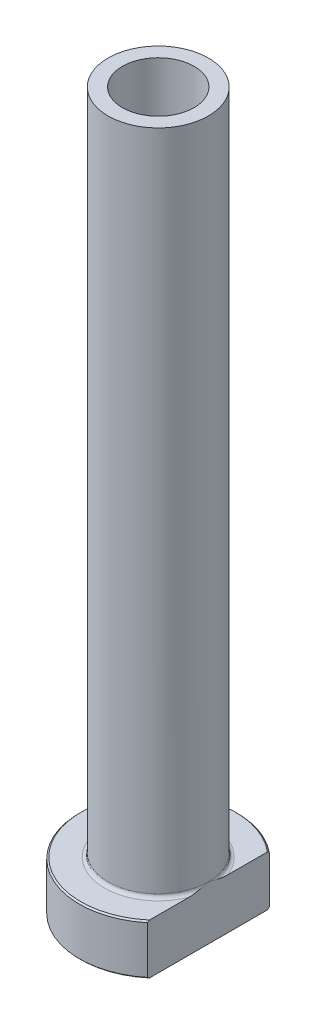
ISO-10303-21;
HEADER;
FILE_DESCRIPTION(('STEP AP214'),'2;1');
FILE_NAME('part.step','',(''),(''),'','','');
FILE_SCHEMA(('AUTOMOTIVE_DESIGN { 1 0 10303 214 1 1 1 1 }'));
ENDSEC;
DATA;
#1=APPLICATION_CONTEXT('core data for automotive mechanical design processes');
#2=APPLICATION_PROTOCOL_DEFINITION('international standard','automotive_design',2000,#1);
#3=PRODUCT_CONTEXT('',#1,'mechanical');
#4=PRODUCT('Part','Part','',(#3));
#5=PRODUCT_RELATED_PRODUCT_CATEGORY('part','',(#4));
#6=PRODUCT_DEFINITION_FORMATION('','',#4);
#7=PRODUCT_DEFINITION_CONTEXT('part definition',#1,'design');
#8=PRODUCT_DEFINITION('design','',#6,#7);
#9=PRODUCT_DEFINITION_SHAPE('','',#8);
#10=(LENGTH_UNIT() NAMED_UNIT(*) SI_UNIT(.MILLI.,.METRE.));
#11=(NAMED_UNIT(*) PLANE_ANGLE_UNIT() SI_UNIT($,.RADIAN.));
#12=(NAMED_UNIT(*) SI_UNIT($,.STERADIAN.) SOLID_ANGLE_UNIT());
#13=UNCERTAINTY_MEASURE_WITH_UNIT(LENGTH_MEASURE(1.E-05),#10,'distance_accuracy_value','');
#14=(GEOMETRIC_REPRESENTATION_CONTEXT(3) GLOBAL_UNCERTAINTY_ASSIGNED_CONTEXT((#13)) GLOBAL_UNIT_ASSIGNED_CONTEXT((#10,
#11,#12)) REPRESENTATION_CONTEXT('',''));
#15=CARTESIAN_POINT('',(0.,0.,0.));
#16=DIRECTION('',(0.,0.,1.));
#17=DIRECTION('',(1.,0.,0.));
#18=AXIS2_PLACEMENT_3D('',#15,#16,#17);
#19=CARTESIAN_POINT('',(0.,92.1876809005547,0.));
#20=DIRECTION('',(0.,1.,0.));
#21=DIRECTION('',(0.,0.,1.));
#22=AXIS2_PLACEMENT_3D('',#19,#20,#21);
#23=CYLINDRICAL_SURFACE('',#22,5.00000000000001);
#24=CARTESIAN_POINT('',(0.,100.,0.));
#25=DIRECTION('',(0.,1.,0.));
#26=DIRECTION('',(0.,0.,1.));
#27=AXIS2_PLACEMENT_3D('',#24,#25,#26);
#28=CIRCLE('',#27,5.00000000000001);
#29=CARTESIAN_POINT('',(0.,100.,5.00000000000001));
#30=VERTEX_POINT('',#29);
#31=EDGE_CURVE('E167',#30,#30,#28,.T.);
#32=ORIENTED_EDGE('',*,*,#31,.T.);
#33=EDGE_LOOP('',(#32));
#34=FACE_BOUND('',#33,.T.);
#35=CARTESIAN_POINT('',(0.,55.,0.));
#36=DIRECTION('',(0.,1.,0.));
#37=DIRECTION('',(0.,0.,1.));
#38=AXIS2_PLACEMENT_3D('',#35,#36,#37);
#39=CIRCLE('',#38,5.00000000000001);
#40=CARTESIAN_POINT('',(0.,55.,5.00000000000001));
#41=VERTEX_POINT('',#40);
#42=EDGE_CURVE('E170',#41,#41,#39,.T.);
#43=ORIENTED_EDGE('',*,*,#42,.F.);
#44=EDGE_LOOP('',(#43));
#45=FACE_BOUND('',#44,.T.);
#46=ADVANCED_FACE('F32',(#34,#45),#23,.F.);
#47=CARTESIAN_POINT('',(-5.00000000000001,100.,0.));
#48=DIRECTION('',(0.,1.,0.));
#49=DIRECTION('',(0.,0.,1.));
#50=AXIS2_PLACEMENT_3D('',#47,#48,#49);
#51=PLANE('',#50);
#52=CARTESIAN_POINT('',(0.,100.,0.));
#53=DIRECTION('',(0.,1.,0.));
#54=DIRECTION('',(0.,0.,1.));
#55=AXIS2_PLACEMENT_3D('',#52,#53,#54);
#56=CIRCLE('',#55,7.);
#57=CARTESIAN_POINT('',(0.,100.,7.));
#58=VERTEX_POINT('',#57);
#59=EDGE_CURVE('E174',#58,#58,#56,.T.);
#60=ORIENTED_EDGE('',*,*,#59,.T.);
#61=EDGE_LOOP('',(#60));
#62=FACE_BOUND('',#61,.T.);
#63=ORIENTED_EDGE('',*,*,#31,.F.);
#64=EDGE_LOOP('',(#63));
#65=FACE_BOUND('',#64,.T.);
#66=ADVANCED_FACE('F157',(#62,#65),#51,.T.);
#67=CARTESIAN_POINT('',(0.,92.1876809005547,0.));
#68=DIRECTION('',(0.,1.,0.));
#69=DIRECTION('',(0.,0.,1.));
#70=AXIS2_PLACEMENT_3D('',#67,#68,#69);
#71=CYLINDRICAL_SURFACE('',#70,7.);
#72=CARTESIAN_POINT('',(0.,7.50000000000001,0.));
#73=DIRECTION('',(0.,1.,0.));
#74=DIRECTION('',(0.,0.,1.));
#75=AXIS2_PLACEMENT_3D('',#72,#73,#74);
#76=CIRCLE('',#75,7.);
#77=CARTESIAN_POINT('',(7.,7.50000000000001,0.));
#78=VERTEX_POINT('',#77);
#79=EDGE_CURVE('E180',#78,#78,#76,.T.);
#80=ORIENTED_EDGE('',*,*,#79,.T.);
#81=EDGE_LOOP('',(#80));
#82=FACE_BOUND('',#81,.T.);
#83=ORIENTED_EDGE('',*,*,#59,.F.);
#84=EDGE_LOOP('',(#83));
#85=FACE_BOUND('',#84,.T.);
#86=ADVANCED_FACE('F162',(#82,#85),#71,.T.);
#87=CARTESIAN_POINT('',(-6.99999999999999,7.,0.));
#88=DIRECTION('',(0.,1.,0.));
#89=DIRECTION('',(0.,0.,1.));
#90=AXIS2_PLACEMENT_3D('',#87,#88,#89);
#91=PLANE('',#90);
#92=DIRECTION('',(0.,0.,1.));
#93=VECTOR('',#92,1.);
#94=CARTESIAN_POINT('',(6.99999999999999,7.,0.));
#95=LINE('',#94,#93);
#96=CARTESIAN_POINT('',(7.,7.,-8.22435407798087));
#97=VERTEX_POINT('',#96);
#98=CARTESIAN_POINT('',(6.99999999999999,7.,-2.69258240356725));
#99=VERTEX_POINT('',#98);
#100=EDGE_CURVE('E54',#97,#99,#95,.T.);
#101=ORIENTED_EDGE('',*,*,#100,.F.);
#102=CARTESIAN_POINT('',(0.,7.,0.));
#103=DIRECTION('',(0.,1.,0.));
#104=DIRECTION('',(0.,0.,1.));
#105=AXIS2_PLACEMENT_3D('',#102,#103,#104);
#106=CIRCLE('',#105,10.8);
#107=CARTESIAN_POINT('',(6.99999999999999,7.,8.22435407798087));
#108=VERTEX_POINT('',#107);
#109=EDGE_CURVE('E186',#97,#108,#106,.T.);
#110=ORIENTED_EDGE('',*,*,#109,.T.);
#111=CARTESIAN_POINT('',(6.99999999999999,7.,2.69258240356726));
#112=VERTEX_POINT('',#111);
#113=EDGE_CURVE('E134',#112,#108,#95,.T.);
#114=ORIENTED_EDGE('',*,*,#113,.F.);
#115=CARTESIAN_POINT('',(0.,7.,0.));
#116=DIRECTION('',(0.,1.,0.));
#117=DIRECTION('',(0.,0.,1.));
#118=AXIS2_PLACEMENT_3D('',#115,#116,#117);
#119=CIRCLE('',#118,7.5);
#120=EDGE_CURVE('E183',#112,#99,#119,.F.);
#121=ORIENTED_EDGE('',*,*,#120,.T.);
#122=EDGE_LOOP('',(#101,#110,#114,#121));
#123=FACE_BOUND('',#122,.T.);
#124=ADVANCED_FACE('F197',(#123),#91,.T.);
#125=CARTESIAN_POINT('',(0.,92.1876809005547,0.));
#126=DIRECTION('',(0.,1.,0.));
#127=DIRECTION('',(0.,0.,1.));
#128=AXIS2_PLACEMENT_3D('',#125,#126,#127);
#129=CYLINDRICAL_SURFACE('',#128,11.);
#130=DIRECTION('',(0.,-1.,0.));
#131=VECTOR('',#130,1.);
#132=CARTESIAN_POINT('',(6.99999999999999,100.,8.48528137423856));
#133=LINE('',#132,#131);
#134=CARTESIAN_POINT('',(6.99999999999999,6.80000000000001,8.48528137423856));
#135=VERTEX_POINT('',#134);
#136=CARTESIAN_POINT('',(6.99999999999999,0.200000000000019,8.48528137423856));
#137=VERTEX_POINT('',#136);
#138=EDGE_CURVE('E82',#135,#137,#133,.T.);
#139=ORIENTED_EDGE('',*,*,#138,.F.);
#140=CARTESIAN_POINT('',(0.,6.80000000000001,0.));
#141=DIRECTION('',(0.,1.,0.));
#142=DIRECTION('',(0.,0.,1.));
#143=AXIS2_PLACEMENT_3D('',#140,#141,#142);
#144=CIRCLE('',#143,11.);
#145=CARTESIAN_POINT('',(7.,6.80000000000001,-8.48528137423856));
#146=VERTEX_POINT('',#145);
#147=EDGE_CURVE('E95',#135,#146,#144,.F.);
#148=ORIENTED_EDGE('',*,*,#147,.T.);
#149=DIRECTION('',(0.,-1.,0.));
#150=VECTOR('',#149,1.);
#151=CARTESIAN_POINT('',(7.,100.,-8.48528137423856));
#152=LINE('',#151,#150);
#153=CARTESIAN_POINT('',(7.,0.20000000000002,-8.48528137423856));
#154=VERTEX_POINT('',#153);
#155=EDGE_CURVE('E192',#146,#154,#152,.T.);
#156=ORIENTED_EDGE('',*,*,#155,.T.);
#157=CARTESIAN_POINT('',(0.,0.20000000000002,0.));
#158=DIRECTION('',(0.,-1.,0.));
#159=DIRECTION('',(0.,0.,-1.));
#160=AXIS2_PLACEMENT_3D('',#157,#158,#159);
#161=CIRCLE('',#160,11.);
#162=EDGE_CURVE('E98',#154,#137,#161,.F.);
#163=ORIENTED_EDGE('',*,*,#162,.T.);
#164=EDGE_LOOP('',(#139,#148,#156,#163));
#165=FACE_BOUND('',#164,.T.);
#166=ADVANCED_FACE('F190',(#165),#129,.T.);
#167=CARTESIAN_POINT('',(-11.,0.,0.));
#168=DIRECTION('',(0.,-1.,0.));
#169=DIRECTION('',(0.,0.,-1.));
#170=AXIS2_PLACEMENT_3D('',#167,#168,#169);
#171=PLANE('',#170);
#172=CARTESIAN_POINT('',(0.,0.,0.));
#173=DIRECTION('',(0.,-1.,0.));
#174=DIRECTION('',(0.,0.,-1.));
#175=AXIS2_PLACEMENT_3D('',#172,#173,#174);
#176=CIRCLE('',#175,5.74999999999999);
#177=CARTESIAN_POINT('',(0.,0.,-5.74999999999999));
#178=VERTEX_POINT('',#177);
#179=EDGE_CURVE('E40',#178,#178,#176,.F.);
#180=ORIENTED_EDGE('',*,*,#179,.T.);
#181=EDGE_LOOP('',(#180));
#182=FACE_BOUND('',#181,.T.);
#183=DIRECTION('',(0.,0.,-1.));
#184=VECTOR('',#183,1.);
#185=CARTESIAN_POINT('',(6.99999999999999,0.,8.48528137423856));
#186=LINE('',#185,#184);
#187=CARTESIAN_POINT('',(6.99999999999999,0.,8.22435407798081));
#188=VERTEX_POINT('',#187);
#189=CARTESIAN_POINT('',(7.,0.,-8.22435407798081));
#190=VERTEX_POINT('',#189);
#191=EDGE_CURVE('E47',#188,#190,#186,.T.);
#192=ORIENTED_EDGE('',*,*,#191,.F.);
#193=CARTESIAN_POINT('',(0.,0.,0.));
#194=DIRECTION('',(0.,-1.,0.));
#195=DIRECTION('',(0.,0.,-1.));
#196=AXIS2_PLACEMENT_3D('',#193,#194,#195);
#197=CIRCLE('',#196,10.8);
#198=EDGE_CURVE('E92',#188,#190,#197,.T.);
#199=ORIENTED_EDGE('',*,*,#198,.T.);
#200=EDGE_LOOP('',(#192,#199));
#201=FACE_BOUND('',#200,.T.);
#202=ADVANCED_FACE('F91',(#182,#201),#171,.T.);
#203=CARTESIAN_POINT('',(0.,92.1876809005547,0.));
#204=DIRECTION('',(0.,1.,0.));
#205=DIRECTION('',(0.,0.,1.));
#206=AXIS2_PLACEMENT_3D('',#203,#204,#205);
#207=CYLINDRICAL_SURFACE('',#206,5.24999999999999);
#208=CARTESIAN_POINT('',(0.,0.5,0.));
#209=DIRECTION('',(0.,-1.,0.));
#210=DIRECTION('',(0.,0.,-1.));
#211=AXIS2_PLACEMENT_3D('',#208,#209,#210);
#212=CIRCLE('',#211,5.24999999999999);
#213=CARTESIAN_POINT('',(0.,0.5,-5.24999999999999));
#214=VERTEX_POINT('',#213);
#215=EDGE_CURVE('E11',#214,#214,#212,.T.);
#216=ORIENTED_EDGE('',*,*,#215,.T.);
#217=EDGE_LOOP('',(#216));
#218=FACE_BOUND('',#217,.T.);
#219=CARTESIAN_POINT('',(0.,43.,0.));
#220=DIRECTION('',(0.,1.,0.));
#221=DIRECTION('',(0.,0.,1.));
#222=AXIS2_PLACEMENT_3D('',#219,#220,#221);
#223=CIRCLE('',#222,5.25);
#224=CARTESIAN_POINT('',(0.,43.,5.25));
#225=VERTEX_POINT('',#224);
#226=EDGE_CURVE('E172',#225,#225,#223,.T.);
#227=ORIENTED_EDGE('',*,*,#226,.T.);
#228=EDGE_LOOP('',(#227));
#229=FACE_BOUND('',#228,.T.);
#230=ADVANCED_FACE('F215',(#218,#229),#207,.F.);
#231=CARTESIAN_POINT('',(0.,43.,0.));
#232=DIRECTION('',(0.,-1.,0.));
#233=DIRECTION('',(0.,0.,-1.));
#234=AXIS2_PLACEMENT_3D('',#231,#232,#233);
#235=CONICAL_SURFACE('',#234,5.25,0.020830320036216);
#236=ORIENTED_EDGE('',*,*,#42,.T.);
#237=EDGE_LOOP('',(#236));
#238=FACE_BOUND('',#237,.T.);
#239=ORIENTED_EDGE('',*,*,#226,.F.);
#240=EDGE_LOOP('',(#239));
#241=FACE_BOUND('',#240,.T.);
#242=ADVANCED_FACE('F111',(#238,#241),#235,.F.);
#243=CARTESIAN_POINT('',(0.,7.50000000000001,0.));
#244=DIRECTION('',(0.,1.,0.));
#245=DIRECTION('',(0.,0.,1.));
#246=AXIS2_PLACEMENT_3D('',#243,#244,#245);
#247=TOROIDAL_SURFACE('',#246,7.5,0.5);
#248=ORIENTED_EDGE('',*,*,#120,.F.);
#249=CARTESIAN_POINT('',(7.,7.50000000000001,0.));
#250=CARTESIAN_POINT('',(7.,7.50000080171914,-1.25554064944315E-10));
#251=CARTESIAN_POINT('',(7.,7.50000160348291,2.9022023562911E-07));
#252=CARTESIAN_POINT('',(7.,7.50000310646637,1.10846433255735E-06));
#253=CARTESIAN_POINT('',(7.,7.50000379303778,1.65470103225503E-06));
#254=CARTESIAN_POINT('',(7.,7.5000052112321,2.96102740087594E-06));
#255=CARTESIAN_POINT('',(7.,7.50000592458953,3.74204162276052E-06));
#256=CARTESIAN_POINT('',(7.,7.5000072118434,5.36891857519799E-06));
#257=CARTESIAN_POINT('',(7.,7.50000778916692,6.21226330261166E-06));
#258=CARTESIAN_POINT('',(7.,7.50000990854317,9.4488967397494E-06));
#259=CARTESIAN_POINT('',(7.,7.50001133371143,1.19224909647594E-05));
#260=CARTESIAN_POINT('',(7.,7.50001370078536,1.68453044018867E-05));
#261=CARTESIAN_POINT('',(7.,7.50001467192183,1.92810858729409E-05));
#262=CARTESIAN_POINT('',(7.,7.50001870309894,2.95057518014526E-05));
#263=CARTESIAN_POINT('',(7.,7.5000216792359,3.73333810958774E-05));
#264=CARTESIAN_POINT('',(7.,7.50002610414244,5.21820401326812E-05));
#265=CARTESIAN_POINT('',(7.,7.50002771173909,5.9155600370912E-05));
#266=CARTESIAN_POINT('',(7.,7.50003935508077,0.000110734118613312));
#267=CARTESIAN_POINT('',(7.,7.5000481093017,0.000155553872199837));
#268=CARTESIAN_POINT('',(7.,7.50008643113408,0.000332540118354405));
#269=CARTESIAN_POINT('',(7.,7.50012307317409,0.000463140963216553));
#270=CARTESIAN_POINT('',(7.,7.50026565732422,0.000980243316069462));
#271=CARTESIAN_POINT('',(7.,7.50036696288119,0.00136762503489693));
#272=CARTESIAN_POINT('',(7.,7.50077257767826,0.00290683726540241));
#273=CARTESIAN_POINT('',(7.,7.50108269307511,0.00405753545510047));
#274=CARTESIAN_POINT('',(7.,7.50237341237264,0.0088598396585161));
#275=CARTESIAN_POINT('',(7.,7.50334676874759,0.0125128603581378));
#276=CARTESIAN_POINT('',(7.,7.51627189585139,0.06100386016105));
#277=CARTESIAN_POINT('',(7.,7.52827280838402,0.105832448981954));
#278=CARTESIAN_POINT('',(7.,7.55170994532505,0.193693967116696));
#279=CARTESIAN_POINT('',(7.,7.5631493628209,0.236726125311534));
#280=CARTESIAN_POINT('',(7.,7.58740418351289,0.328321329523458));
#281=CARTESIAN_POINT('',(7.,7.60020832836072,0.376887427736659));
#282=CARTESIAN_POINT('',(7.,7.62578161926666,0.474605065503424));
#283=CARTESIAN_POINT('',(7.,7.63854879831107,0.523757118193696));
#284=CARTESIAN_POINT('',(7.,7.66904753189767,0.64236612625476));
#285=CARTESIAN_POINT('',(7.,7.68665961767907,0.711854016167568));
#286=CARTESIAN_POINT('',(7.,7.72074501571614,0.849103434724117));
#287=CARTESIAN_POINT('',(7.,7.73723627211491,0.91686051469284));
#288=CARTESIAN_POINT('',(7.,7.79038156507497,1.14104210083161));
#289=CARTESIAN_POINT('',(7.,7.82528973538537,1.29788860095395));
#290=CARTESIAN_POINT('',(7.,7.88862298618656,1.61471917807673));
#291=CARTESIAN_POINT('',(7.,7.91697354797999,1.77471883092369));
#292=CARTESIAN_POINT('',(7.,7.95258292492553,2.02253505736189));
#293=CARTESIAN_POINT('',(7.,7.96355251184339,2.10981398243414));
#294=CARTESIAN_POINT('',(7.,7.98165287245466,2.28476193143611));
#295=CARTESIAN_POINT('',(7.,7.98878459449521,2.37243085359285));
#296=CARTESIAN_POINT('',(7.,7.99822919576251,2.54760327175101));
#297=CARTESIAN_POINT('',(7.,8.00056589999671,2.63510541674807));
#298=CARTESIAN_POINT('',(7.,7.99919996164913,2.81004074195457));
#299=CARTESIAN_POINT('',(7.,7.99550272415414,2.89747391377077));
#300=CARTESIAN_POINT('',(7.,7.98391011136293,3.028820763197));
#301=CARTESIAN_POINT('',(7.,7.97897237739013,3.07299684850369));
#302=CARTESIAN_POINT('',(7.,7.96665453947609,3.16105400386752));
#303=CARTESIAN_POINT('',(7.,7.95927246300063,3.20493480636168));
#304=CARTESIAN_POINT('',(7.,7.94168688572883,3.29163191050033));
#305=CARTESIAN_POINT('',(7.,7.93151559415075,3.33445462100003));
#306=CARTESIAN_POINT('',(7.,7.90768392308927,3.4190965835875));
#307=CARTESIAN_POINT('',(7.,7.8940274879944,3.46091691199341));
#308=CARTESIAN_POINT('',(7.,7.86214701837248,3.54331777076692));
#309=CARTESIAN_POINT('',(7.,7.84387618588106,3.58388050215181));
#310=CARTESIAN_POINT('',(7.,7.80145892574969,3.66184445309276));
#311=CARTESIAN_POINT('',(7.,7.77733569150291,3.69925738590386));
#312=CARTESIAN_POINT('',(7.,7.73714014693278,3.74836513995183));
#313=CARTESIAN_POINT('',(7.,7.72423208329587,3.76263695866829));
#314=CARTESIAN_POINT('',(7.,7.69673765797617,3.7895167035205));
#315=CARTESIAN_POINT('',(7.,7.68215013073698,3.80212346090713));
#316=CARTESIAN_POINT('',(7.,7.65099843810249,3.82514624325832));
#317=CARTESIAN_POINT('',(7.,7.63441049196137,3.83553078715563));
#318=CARTESIAN_POINT('',(7.,7.59955798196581,3.85294010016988));
#319=CARTESIAN_POINT('',(7.,7.58129885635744,3.85997533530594));
#320=CARTESIAN_POINT('',(7.,7.54906837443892,3.86837810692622));
#321=CARTESIAN_POINT('',(7.,7.53536870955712,3.87079233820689));
#322=CARTESIAN_POINT('',(7.,7.50775756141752,3.87325240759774));
#323=CARTESIAN_POINT('',(7.,7.49384618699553,3.87329942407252));
#324=CARTESIAN_POINT('',(7.,7.46623771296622,3.87102093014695));
#325=CARTESIAN_POINT('',(7.,7.45254041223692,3.8686978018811));
#326=CARTESIAN_POINT('',(7.,7.42569741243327,3.86188775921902));
#327=CARTESIAN_POINT('',(7.,7.41255212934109,3.85739924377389));
#328=CARTESIAN_POINT('',(7.,7.38259319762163,3.84468786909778));
#329=CARTESIAN_POINT('',(7.,7.36610215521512,3.83570823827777));
#330=CARTESIAN_POINT('',(7.,7.33476729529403,3.81523202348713));
#331=CARTESIAN_POINT('',(7.,7.31992737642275,3.80372966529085));
#332=CARTESIAN_POINT('',(7.,7.28371925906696,3.77170797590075));
#333=CARTESIAN_POINT('',(7.,7.26356272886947,3.74983059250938));
#334=CARTESIAN_POINT('',(7.,7.22671696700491,3.70338283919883));
#335=CARTESIAN_POINT('',(7.,7.21003361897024,3.67880800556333));
#336=CARTESIAN_POINT('',(7.,7.18026553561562,3.62921731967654));
#337=CARTESIAN_POINT('',(7.,7.16704475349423,3.60428175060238));
#338=CARTESIAN_POINT('',(7.,7.14275069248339,3.55337478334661));
#339=CARTESIAN_POINT('',(7.,7.13167947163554,3.52740242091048));
#340=CARTESIAN_POINT('',(7.,7.10104499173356,3.44809573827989));
#341=CARTESIAN_POINT('',(7.,7.08424174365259,3.39369851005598));
#342=CARTESIAN_POINT('',(7.,7.05431378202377,3.27667221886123));
#343=CARTESIAN_POINT('',(7.,7.04191718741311,3.21386807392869));
#344=CARTESIAN_POINT('',(7.,7.02234605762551,3.08735184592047));
#345=CARTESIAN_POINT('',(7.,7.01518234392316,3.02363815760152));
#346=CARTESIAN_POINT('',(7.,7.00517826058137,2.89779001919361));
#347=CARTESIAN_POINT('',(7.,7.00221627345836,2.83566460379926));
#348=CARTESIAN_POINT('',(7.,6.99952325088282,2.71160626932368));
#349=CARTESIAN_POINT('',(7.,6.99977918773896,2.64967358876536));
#350=CARTESIAN_POINT('',(7.,7.00377761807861,2.49407814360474));
#351=CARTESIAN_POINT('',(7.,7.00924384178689,2.40046113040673));
#352=CARTESIAN_POINT('',(7.,7.02494106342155,2.21367396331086));
#353=CARTESIAN_POINT('',(7.,7.03517106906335,2.12050372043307));
#354=CARTESIAN_POINT('',(7.,7.05969765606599,1.93249035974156));
#355=CARTESIAN_POINT('',(7.,7.07408383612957,1.83765914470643));
#356=CARTESIAN_POINT('',(7.,7.10603300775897,1.64829340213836));
#357=CARTESIAN_POINT('',(7.,7.12360402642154,1.55376025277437));
#358=CARTESIAN_POINT('',(7.,7.16806468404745,1.33086107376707));
#359=CARTESIAN_POINT('',(7.,7.19601783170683,1.20270896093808));
#360=CARTESIAN_POINT('',(7.,7.25475947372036,0.948586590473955));
#361=CARTESIAN_POINT('',(7.,7.28551257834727,0.82260799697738));
#362=CARTESIAN_POINT('',(7.,7.33123897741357,0.641334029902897));
#363=CARTESIAN_POINT('',(7.,7.34543722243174,0.585840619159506));
#364=CARTESIAN_POINT('',(7.,7.37418243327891,0.474686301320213));
#365=CARTESIAN_POINT('',(7.,7.38873064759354,0.419025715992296));
#366=CARTESIAN_POINT('',(7.,7.41873357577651,0.305011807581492));
#367=CARTESIAN_POINT('',(7.,7.43419762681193,0.246660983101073));
#368=CARTESIAN_POINT('',(7.,7.4650236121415,0.130933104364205));
#369=CARTESIAN_POINT('',(7.,7.48038319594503,0.0735554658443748));
#370=CARTESIAN_POINT('',(7.,7.49665455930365,0.0125077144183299));
#371=CARTESIAN_POINT('',(7.,7.497629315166,0.0088495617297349));
#372=CARTESIAN_POINT('',(7.,7.4989203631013,0.00404608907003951));
#373=CARTESIAN_POINT('',(7.,7.49922940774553,0.0028993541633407));
#374=CARTESIAN_POINT('',(7.,7.49963371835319,0.00136508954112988));
#375=CARTESIAN_POINT('',(7.,7.49973476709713,0.000978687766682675));
#376=CARTESIAN_POINT('',(7.,7.49987704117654,0.000462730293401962));
#377=CARTESIAN_POINT('',(7.,7.49991363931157,0.000332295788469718));
#378=CARTESIAN_POINT('',(7.,7.49995192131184,0.000155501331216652));
#379=CARTESIAN_POINT('',(7.,7.49996067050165,0.000110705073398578));
#380=CARTESIAN_POINT('',(7.,7.499972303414,5.91504846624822E-05));
#381=CARTESIAN_POINT('',(7.,7.49997390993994,5.21782449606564E-05));
#382=CARTESIAN_POINT('',(7.,7.49997833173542,3.73322798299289E-05));
#383=CARTESIAN_POINT('',(7.,7.49998130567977,2.95059537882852E-05));
#384=CARTESIAN_POINT('',(7.,7.49998533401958,1.92826346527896E-05));
#385=CARTESIAN_POINT('',(7.,7.49998630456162,1.68469519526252E-05));
#386=CARTESIAN_POINT('',(7.,7.49998867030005,1.19242368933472E-05));
#387=CARTESIAN_POINT('',(7.,7.49999009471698,9.45063020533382E-06));
#388=CARTESIAN_POINT('',(7.,7.49999221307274,6.21386426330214E-06));
#389=CARTESIAN_POINT('',(7.,7.4999927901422,5.37045286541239E-06));
#390=CARTESIAN_POINT('',(7.,7.49999407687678,3.74339671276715E-06));
#391=CARTESIAN_POINT('',(7.,7.49999478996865,2.96226841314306E-06));
#392=CARTESIAN_POINT('',(7.,7.4999962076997,1.65567332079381E-06));
#393=CARTESIAN_POINT('',(7.,7.49999689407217,1.10929181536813E-06));
#394=CARTESIAN_POINT('',(7.,7.49999839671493,2.9068311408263E-07));
#395=CARTESIAN_POINT('',(7.,7.49999919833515,1.25546997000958E-10));
#396=CARTESIAN_POINT('',(7.,7.50000000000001,0.));
#397=B_SPLINE_CURVE_WITH_KNOTS('',3,(#249,#250,#251,#252,#253,#254,#255,#256,#257,#258,#259,
#260,#261,#262,#263,#264,#265,#266,#267,#268,#269,#270,#271,#272,#273,#274,#275,#276,#277,#278,
#279,#280,#281,#282,#283,#284,#285,#286,#287,#288,#289,#290,#291,#292,#293,#294,#295,#296,#297,
#298,#299,#300,#301,#302,#303,#304,#305,#306,#307,#308,#309,#310,#311,#312,#313,#314,#315,#316,
#317,#318,#319,#320,#321,#322,#323,#324,#325,#326,#327,#328,#329,#330,#331,#332,#333,#334,#335,
#336,#337,#338,#339,#340,#341,#342,#343,#344,#345,#346,#347,#348,#349,#350,#351,#352,#353,#354,
#355,#356,#357,#358,#359,#360,#361,#362,#363,#364,#365,#366,#367,#368,#369,#370,#371,#372,#373,
#374,#375,#376,#377,#378,#379,#380,#381,#382,#383,#384,#385,#386,#387,#388,#389,#390,#391,#392,
#393,#394,#395,#396),.UNSPECIFIED.,.T.,.F.,(4,2,2,2,2,2,2,2,2,2,2,2,2,2,2,2,2,2,2,2,2,2,2,2,2,2,
2,2,2,2,2,2,2,2,2,2,2,2,2,2,2,2,2,2,2,2,2,2,2,2,2,2,2,2,2,2,2,2,2,2,2,2,2,2,2,2,2,2,2,2,2,2,2,
4),(0.,2.42201486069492E-06,5.05304980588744E-06,8.20814258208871E-06,1.12722951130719E-05,
1.98044039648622E-05,2.76642093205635E-05,5.27403873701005E-05,7.41830821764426E-05,
0.000211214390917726,0.000617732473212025,0.00181938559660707,0.00539412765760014,
0.0167361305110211,0.155952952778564,0.289534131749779,0.440210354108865,0.592559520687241,
0.807611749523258,1.01681499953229,1.49878389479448,1.98598665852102,2.24981935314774,
2.51358682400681,2.77604050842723,3.0382592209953,3.17156039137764,3.3049693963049,
3.43689837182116,3.56867869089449,3.70185328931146,3.83450849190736,3.89212877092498,
3.94978928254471,4.00821928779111,4.06646549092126,4.10801107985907,4.14953598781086,
4.19101920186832,4.23253313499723,4.28854866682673,4.34469377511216,4.43343413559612,
4.52232362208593,4.60686785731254,4.69149264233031,4.861851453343,5.05362927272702,
5.24580256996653,5.43229132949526,5.61802533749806,5.8991838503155,6.18028382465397,
6.46796485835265,6.75638131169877,7.14981284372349,7.53882346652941,7.71066604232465,
7.88325629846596,8.0643532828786,8.24254095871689,8.25389891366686,8.25746134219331,
8.25865995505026,8.25906595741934,8.25920291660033,8.25922435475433,8.25924942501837,
8.25925728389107,8.25926581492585,8.25926887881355,8.25927203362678,8.25927466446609,
8.259277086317),.UNSPECIFIED.);
#398=EDGE_CURVE('E126',#112,#78,#397,.T.);
#399=ORIENTED_EDGE('',*,*,#398,.T.);
#400=ORIENTED_EDGE('',*,*,#79,.F.);
#401=CARTESIAN_POINT('',(7.,7.50000000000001,0.));
#402=CARTESIAN_POINT('',(7.,7.49999919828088,1.25555359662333E-10));
#403=CARTESIAN_POINT('',(7.,7.4999983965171,-2.90220234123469E-07));
#404=CARTESIAN_POINT('',(7.,7.49999689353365,-1.10846433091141E-06));
#405=CARTESIAN_POINT('',(7.,7.49999620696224,-1.65470103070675E-06));
#406=CARTESIAN_POINT('',(7.,7.49999478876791,-2.96102739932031E-06));
#407=CARTESIAN_POINT('',(7.,7.49999407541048,-3.74204162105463E-06));
#408=CARTESIAN_POINT('',(7.,7.49999278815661,-5.36891857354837E-06));
#409=CARTESIAN_POINT('',(7.,7.49999221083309,-6.21226330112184E-06));
#410=CARTESIAN_POINT('',(7.,7.49999009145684,-9.44889673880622E-06));
#411=CARTESIAN_POINT('',(7.,7.49998866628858,-1.19224909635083E-05));
#412=CARTESIAN_POINT('',(7.,7.49998629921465,-1.68453044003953E-05));
#413=CARTESIAN_POINT('',(7.,7.49998532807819,-1.92810858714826E-05));
#414=CARTESIAN_POINT('',(7.,7.49998129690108,-2.95057518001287E-05));
#415=CARTESIAN_POINT('',(7.,7.49997832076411,-3.73333810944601E-05));
#416=CARTESIAN_POINT('',(7.,7.49997389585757,-5.21820401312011E-05));
#417=CARTESIAN_POINT('',(7.,7.49997228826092,-5.91556003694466E-05));
#418=CARTESIAN_POINT('',(7.,7.49996064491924,-0.000110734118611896));
#419=CARTESIAN_POINT('',(7.,7.49995189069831,-0.000155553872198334));
#420=CARTESIAN_POINT('',(7.,7.49991356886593,-0.000332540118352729));
#421=CARTESIAN_POINT('',(7.,7.49987692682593,-0.000463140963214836));
#422=CARTESIAN_POINT('',(7.,7.49973434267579,-0.000980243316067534));
#423=CARTESIAN_POINT('',(7.,7.49963303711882,-0.001367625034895));
#424=CARTESIAN_POINT('',(7.,7.49922742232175,-0.00290683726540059));
#425=CARTESIAN_POINT('',(7.,7.4989173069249,-0.0040575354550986));
#426=CARTESIAN_POINT('',(7.,7.49762658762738,-0.00885983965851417));
#427=CARTESIAN_POINT('',(7.,7.49665323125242,-0.0125128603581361));
#428=CARTESIAN_POINT('',(7.,7.48372810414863,-0.0610038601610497));
#429=CARTESIAN_POINT('',(7.,7.47172719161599,-0.105832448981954));
#430=CARTESIAN_POINT('',(7.,7.44829005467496,-0.193693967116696));
#431=CARTESIAN_POINT('',(7.,7.43685063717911,-0.236726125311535));
#432=CARTESIAN_POINT('',(7.,7.41259581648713,-0.32832132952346));
#433=CARTESIAN_POINT('',(7.,7.3997916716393,-0.376887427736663));
#434=CARTESIAN_POINT('',(7.,7.37421838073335,-0.474605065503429));
#435=CARTESIAN_POINT('',(7.,7.36145120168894,-0.523757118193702));
#436=CARTESIAN_POINT('',(7.,7.33095246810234,-0.642366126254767));
#437=CARTESIAN_POINT('',(7.,7.31334038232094,-0.711854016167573));
#438=CARTESIAN_POINT('',(7.,7.27925498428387,-0.849103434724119));
#439=CARTESIAN_POINT('',(7.,7.2627637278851,-0.91686051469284));
#440=CARTESIAN_POINT('',(7.,7.20961843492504,-1.1410421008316));
#441=CARTESIAN_POINT('',(7.,7.17471026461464,-1.29788860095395));
#442=CARTESIAN_POINT('',(7.,7.11137701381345,-1.61471917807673));
#443=CARTESIAN_POINT('',(7.,7.08302645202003,-1.77471883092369));
#444=CARTESIAN_POINT('',(7.,7.04741707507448,-2.02253505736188));
#445=CARTESIAN_POINT('',(7.,7.03644748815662,-2.10981398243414));
#446=CARTESIAN_POINT('',(7.,7.01834712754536,-2.2847619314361));
#447=CARTESIAN_POINT('',(7.,7.0112154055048,-2.37243085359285));
#448=CARTESIAN_POINT('',(7.,7.0017708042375,-2.54760327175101));
#449=CARTESIAN_POINT('',(7.,6.99943410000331,-2.63510541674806));
#450=CARTESIAN_POINT('',(7.,7.00080003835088,-2.81004074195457));
#451=CARTESIAN_POINT('',(7.,7.00449727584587,-2.89747391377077));
#452=CARTESIAN_POINT('',(7.,7.01608988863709,-3.02882076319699));
#453=CARTESIAN_POINT('',(7.,7.02102762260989,-3.07299684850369));
#454=CARTESIAN_POINT('',(7.,7.03334546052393,-3.16105400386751));
#455=CARTESIAN_POINT('',(7.,7.04072753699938,-3.20493480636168));
#456=CARTESIAN_POINT('',(7.,7.05831311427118,-3.29163191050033));
#457=CARTESIAN_POINT('',(7.,7.06848440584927,-3.33445462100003));
#458=CARTESIAN_POINT('',(7.,7.09231607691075,-3.4190965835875));
#459=CARTESIAN_POINT('',(7.,7.10597251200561,-3.46091691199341));
#460=CARTESIAN_POINT('',(7.,7.13785298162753,-3.54331777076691));
#461=CARTESIAN_POINT('',(7.,7.15612381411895,-3.5838805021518));
#462=CARTESIAN_POINT('',(7.,7.19854107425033,-3.66184445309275));
#463=CARTESIAN_POINT('',(7.,7.2226643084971,-3.69925738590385));
#464=CARTESIAN_POINT('',(7.,7.26285985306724,-3.74836513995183));
#465=CARTESIAN_POINT('',(7.,7.27576791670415,-3.76263695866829));
#466=CARTESIAN_POINT('',(7.,7.30326234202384,-3.7895167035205));
#467=CARTESIAN_POINT('',(7.,7.31784986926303,-3.80212346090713));
#468=CARTESIAN_POINT('',(7.,7.34900156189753,-3.82514624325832));
#469=CARTESIAN_POINT('',(7.,7.36558950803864,-3.83553078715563));
#470=CARTESIAN_POINT('',(7.,7.40044201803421,-3.85294010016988));
#471=CARTESIAN_POINT('',(7.,7.41870114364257,-3.85997533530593));
#472=CARTESIAN_POINT('',(7.,7.45093162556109,-3.86837810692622));
#473=CARTESIAN_POINT('',(7.,7.46463129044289,-3.8707923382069));
#474=CARTESIAN_POINT('',(7.,7.4922424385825,-3.87325240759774));
#475=CARTESIAN_POINT('',(7.,7.50615381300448,-3.87329942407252));
#476=CARTESIAN_POINT('',(7.,7.53376228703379,-3.87102093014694));
#477=CARTESIAN_POINT('',(7.,7.54745958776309,-3.8686978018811));
#478=CARTESIAN_POINT('',(7.,7.57430258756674,-3.86188775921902));
#479=CARTESIAN_POINT('',(7.,7.58744787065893,-3.85739924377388));
#480=CARTESIAN_POINT('',(7.,7.61740680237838,-3.84468786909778));
#481=CARTESIAN_POINT('',(7.,7.6338978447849,-3.83570823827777));
#482=CARTESIAN_POINT('',(7.,7.66523270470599,-3.81523202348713));
#483=CARTESIAN_POINT('',(7.,7.68007262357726,-3.80372966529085));
#484=CARTESIAN_POINT('',(7.,7.71628074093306,-3.77170797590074));
#485=CARTESIAN_POINT('',(7.,7.73643727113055,-3.74983059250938));
#486=CARTESIAN_POINT('',(7.,7.77328303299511,-3.70338283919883));
#487=CARTESIAN_POINT('',(7.,7.78996638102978,-3.67880800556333));
#488=CARTESIAN_POINT('',(7.,7.8197344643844,-3.62921731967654));
#489=CARTESIAN_POINT('',(7.,7.83295524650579,-3.60428175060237));
#490=CARTESIAN_POINT('',(7.,7.85724930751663,-3.5533747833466));
#491=CARTESIAN_POINT('',(7.,7.86832052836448,-3.52740242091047));
#492=CARTESIAN_POINT('',(7.,7.89895500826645,-3.44809573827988));
#493=CARTESIAN_POINT('',(7.,7.91575825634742,-3.39369851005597));
#494=CARTESIAN_POINT('',(7.,7.94568621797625,-3.27667221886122));
#495=CARTESIAN_POINT('',(7.,7.9580828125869,-3.21386807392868));
#496=CARTESIAN_POINT('',(7.,7.97765394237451,-3.08735184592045));
#497=CARTESIAN_POINT('',(7.,7.98481765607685,-3.0236381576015));
#498=CARTESIAN_POINT('',(7.,7.99482173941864,-2.89779001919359));
#499=CARTESIAN_POINT('',(7.,7.99778372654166,-2.83566460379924));
#500=CARTESIAN_POINT('',(7.,8.00047674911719,-2.71160626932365));
#501=CARTESIAN_POINT('',(7.,8.00022081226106,-2.64967358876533));
#502=CARTESIAN_POINT('',(7.,7.99622238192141,-2.49407814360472));
#503=CARTESIAN_POINT('',(7.,7.99075615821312,-2.40046113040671));
#504=CARTESIAN_POINT('',(7.,7.97505893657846,-2.21367396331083));
#505=CARTESIAN_POINT('',(7.,7.96482893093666,-2.12050372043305));
#506=CARTESIAN_POINT('',(7.,7.94030234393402,-1.93249035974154));
#507=CARTESIAN_POINT('',(7.,7.92591616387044,-1.83765914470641));
#508=CARTESIAN_POINT('',(7.,7.89396699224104,-1.64829340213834));
#509=CARTESIAN_POINT('',(7.,7.87639597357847,-1.55376025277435));
#510=CARTESIAN_POINT('',(7.,7.83193531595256,-1.33086107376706));
#511=CARTESIAN_POINT('',(7.,7.80398216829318,-1.20270896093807));
#512=CARTESIAN_POINT('',(7.,7.74524052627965,-0.948586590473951));
#513=CARTESIAN_POINT('',(7.,7.71448742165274,-0.822607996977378));
#514=CARTESIAN_POINT('',(7.,7.66876102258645,-0.641334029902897));
#515=CARTESIAN_POINT('',(7.,7.65456277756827,-0.585840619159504));
#516=CARTESIAN_POINT('',(7.,7.6258175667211,-0.474686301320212));
#517=CARTESIAN_POINT('',(7.,7.61126935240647,-0.419025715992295));
#518=CARTESIAN_POINT('',(7.,7.58126642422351,-0.305011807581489));
#519=CARTESIAN_POINT('',(7.,7.56580237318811,-0.246660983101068));
#520=CARTESIAN_POINT('',(7.,7.5349763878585,-0.130933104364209));
#521=CARTESIAN_POINT('',(7.,7.51961680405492,-0.073555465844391));
#522=CARTESIAN_POINT('',(7.,7.50334544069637,-0.012507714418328));
#523=CARTESIAN_POINT('',(7.,7.50237068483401,-0.00884956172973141));
#524=CARTESIAN_POINT('',(7.,7.50107963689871,-0.00404608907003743));
#525=CARTESIAN_POINT('',(7.,7.50077059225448,-0.00289935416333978));
#526=CARTESIAN_POINT('',(7.,7.50036628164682,-0.00136508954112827));
#527=CARTESIAN_POINT('',(7.,7.50026523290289,-0.000978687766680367));
#528=CARTESIAN_POINT('',(7.,7.50012295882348,-0.00046273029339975));
#529=CARTESIAN_POINT('',(7.,7.50008636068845,-0.000332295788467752));
#530=CARTESIAN_POINT('',(7.,7.50004807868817,-0.000155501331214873));
#531=CARTESIAN_POINT('',(7.,7.50003932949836,-0.000110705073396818));
#532=CARTESIAN_POINT('',(7.,7.50002769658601,-5.91504846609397E-05));
#533=CARTESIAN_POINT('',(7.,7.50002609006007,-5.21782449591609E-05));
#534=CARTESIAN_POINT('',(7.,7.50002166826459,-3.7332279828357E-05));
#535=CARTESIAN_POINT('',(7.,7.50001869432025,-2.95059537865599E-05));
#536=CARTESIAN_POINT('',(7.,7.50001466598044,-1.92826346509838E-05));
#537=CARTESIAN_POINT('',(7.,7.50001369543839,-1.68469519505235E-05));
#538=CARTESIAN_POINT('',(7.,7.50001132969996,-1.1924236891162E-05));
#539=CARTESIAN_POINT('',(7.,7.50000990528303,-9.45063020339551E-06));
#540=CARTESIAN_POINT('',(7.,7.50000778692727,-6.21386426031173E-06));
#541=CARTESIAN_POINT('',(7.,7.50000720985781,-5.37045286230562E-06));
#542=CARTESIAN_POINT('',(7.,7.50000592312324,-3.74339671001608E-06));
#543=CARTESIAN_POINT('',(7.,7.50000521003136,-2.96226841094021E-06));
#544=CARTESIAN_POINT('',(7.,7.50000379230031,-1.65567331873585E-06));
#545=CARTESIAN_POINT('',(7.,7.50000310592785,-1.10929181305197E-06));
#546=CARTESIAN_POINT('',(7.,7.50000160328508,-2.90683111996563E-07));
#547=CARTESIAN_POINT('',(7.,7.50000080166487,-1.25545429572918E-10));
#548=CARTESIAN_POINT('',(7.,7.50000000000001,0.));
#549=B_SPLINE_CURVE_WITH_KNOTS('',3,(#401,#402,#403,#404,#405,#406,#407,#408,#409,#410,#411,
#412,#413,#414,#415,#416,#417,#418,#419,#420,#421,#422,#423,#424,#425,#426,#427,#428,#429,#430,
#431,#432,#433,#434,#435,#436,#437,#438,#439,#440,#441,#442,#443,#444,#445,#446,#447,#448,#449,
#450,#451,#452,#453,#454,#455,#456,#457,#458,#459,#460,#461,#462,#463,#464,#465,#466,#467,#468,
#469,#470,#471,#472,#473,#474,#475,#476,#477,#478,#479,#480,#481,#482,#483,#484,#485,#486,#487,
#488,#489,#490,#491,#492,#493,#494,#495,#496,#497,#498,#499,#500,#501,#502,#503,#504,#505,#506,
#507,#508,#509,#510,#511,#512,#513,#514,#515,#516,#517,#518,#519,#520,#521,#522,#523,#524,#525,
#526,#527,#528,#529,#530,#531,#532,#533,#534,#535,#536,#537,#538,#539,#540,#541,#542,#543,#544,
#545,#546,#547,#548),.UNSPECIFIED.,.T.,.F.,(4,2,2,2,2,2,2,2,2,2,2,2,2,2,2,2,2,2,2,2,2,2,2,2,2,2,
2,2,2,2,2,2,2,2,2,2,2,2,2,2,2,2,2,2,2,2,2,2,2,2,2,2,2,2,2,2,2,2,2,2,2,2,2,2,2,2,2,2,2,2,2,2,2,
4),(0.,2.42201486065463E-06,5.05304980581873E-06,8.20814258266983E-06,1.12722951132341E-05,
1.98044039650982E-05,2.76642093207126E-05,5.27403873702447E-05,7.41830821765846E-05,
0.000211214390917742,0.000617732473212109,0.00181938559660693,0.00539412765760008,
0.0167361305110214,0.155952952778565,0.289534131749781,0.440210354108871,0.592559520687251,
0.807611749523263,1.01681499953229,1.49878389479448,1.98598665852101,2.24981935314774,
2.51358682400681,2.77604050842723,3.0382592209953,3.17156039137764,3.30496939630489,
3.43689837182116,3.56867869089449,3.70185328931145,3.83450849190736,3.89212877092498,
3.94978928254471,4.00821928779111,4.06646549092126,4.10801107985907,4.14953598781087,
4.19101920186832,4.23253313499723,4.28854866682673,4.34469377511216,4.43343413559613,
4.52232362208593,4.60686785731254,4.69149264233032,4.86185145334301,5.05362927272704,
5.24580256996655,5.43229132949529,5.61802533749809,5.89918385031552,6.180283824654,
6.46796485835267,6.75638131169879,7.14981284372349,7.53882346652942,7.71066604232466,
7.88325629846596,8.0643532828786,8.24254095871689,8.25389891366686,8.25746134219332,
8.25865995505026,8.25906595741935,8.25920291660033,8.25922435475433,8.25924942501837,
8.25925728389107,8.25926581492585,8.25926887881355,8.25927203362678,8.25927466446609,
8.259277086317),.UNSPECIFIED.);
#550=EDGE_CURVE('E135',#78,#99,#549,.T.);
#551=ORIENTED_EDGE('',*,*,#550,.T.);
#552=EDGE_LOOP('',(#248,#399,#400,#551));
#553=FACE_BOUND('',#552,.T.);
#554=ADVANCED_FACE('F141',(#553),#247,.F.);
#555=CARTESIAN_POINT('',(0.,7.00000000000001,0.));
#556=DIRECTION('',(0.,-1.,0.));
#557=DIRECTION('',(0.,0.,-1.));
#558=AXIS2_PLACEMENT_3D('',#555,#556,#557);
#559=CONICAL_SURFACE('',#558,10.8,0.785398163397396);
#560=CARTESIAN_POINT('',(7.,-2.13774979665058,-18.6685261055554));
#561=CARTESIAN_POINT('',(7.,-1.86574872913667,-18.3780244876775));
#562=CARTESIAN_POINT('',(7.,-1.59415659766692,-18.0871392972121));
#563=CARTESIAN_POINT('',(7.,-1.05192877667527,-17.5044755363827));
#564=CARTESIAN_POINT('',(7.,-0.781293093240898,-17.2126969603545));
#565=CARTESIAN_POINT('',(7.,-0.241050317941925,-16.6280482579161));
#566=CARTESIAN_POINT('',(7.,0.0285564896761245,-16.3351778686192));
#567=CARTESIAN_POINT('',(7.,0.566485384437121,-15.7482616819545));
#568=CARTESIAN_POINT('',(7.,0.83480747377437,-15.4542158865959));
#569=CARTESIAN_POINT('',(7.,1.64198377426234,-14.5651645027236));
#570=CARTESIAN_POINT('',(7.,2.1785642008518,-13.9680841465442));
#571=CARTESIAN_POINT('',(7.,2.97696333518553,-13.0668144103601));
#572=CARTESIAN_POINT('',(7.,3.2419978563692,-12.7654727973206));
#573=CARTESIAN_POINT('',(7.,3.76945856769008,-12.1605141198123));
#574=CARTESIAN_POINT('',(7.,4.03188476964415,-11.8568970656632));
#575=CARTESIAN_POINT('',(7.,4.50733797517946,-11.3009625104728));
#576=CARTESIAN_POINT('',(7.,4.72088020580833,-11.0490858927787));
#577=CARTESIAN_POINT('',(7.,5.1453807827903,-10.5431655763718));
#578=CARTESIAN_POINT('',(7.,5.35633915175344,-10.2891218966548));
#579=CARTESIAN_POINT('',(7.,5.77522964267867,-9.77836737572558));
#580=CARTESIAN_POINT('',(7.,5.98316044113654,-9.52165544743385));
#581=CARTESIAN_POINT('',(7.,6.39521098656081,-9.00519084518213));
#582=CARTESIAN_POINT('',(7.,6.59933078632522,-8.74543821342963));
#583=CARTESIAN_POINT('',(7.,7.00243445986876,-8.2228360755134));
#584=CARTESIAN_POINT('',(7.,7.20142819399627,-7.9599941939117));
#585=CARTESIAN_POINT('',(7.,7.59353840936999,-7.42991856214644));
#586=CARTESIAN_POINT('',(7.,7.78665447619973,-7.16268450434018));
#587=CARTESIAN_POINT('',(7.,8.16523718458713,-6.62311113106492));
#588=CARTESIAN_POINT('',(7.,8.35070911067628,-6.35077553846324));
#589=CARTESIAN_POINT('',(7.,8.71189725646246,-5.79973731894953));
#590=CARTESIAN_POINT('',(7.,8.88761537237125,-5.52103594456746));
#591=CARTESIAN_POINT('',(7.,9.19554959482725,-5.00707921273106));
#592=CARTESIAN_POINT('',(7.,9.32988075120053,-4.77309669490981));
#593=CARTESIAN_POINT('',(7.,9.58764253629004,-4.29911523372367));
#594=CARTESIAN_POINT('',(7.,9.71107181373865,-4.05911554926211));
#595=CARTESIAN_POINT('',(7.,9.9439090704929,-3.57263619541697));
#596=CARTESIAN_POINT('',(7.,10.053330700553,-3.32616312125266));
#597=CARTESIAN_POINT('',(7.,10.2545146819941,-2.82607166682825));
#598=CARTESIAN_POINT('',(7.,10.3462820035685,-2.57245532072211));
#599=CARTESIAN_POINT('',(7.,10.4907049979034,-2.11254447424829));
#600=CARTESIAN_POINT('',(7.,10.5475277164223,-1.9075661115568));
#601=CARTESIAN_POINT('',(7.,10.6452043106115,-1.49381161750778));
#602=CARTESIAN_POINT('',(7.,10.68606033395,-1.28503600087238));
#603=CARTESIAN_POINT('',(7.,10.7497550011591,-0.865342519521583));
#604=CARTESIAN_POINT('',(7.,10.7726462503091,-0.654432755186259));
#605=CARTESIAN_POINT('',(7.,10.7993569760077,-0.231396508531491));
#606=CARTESIAN_POINT('',(7.,10.8031771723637,-0.0192700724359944));
#607=CARTESIAN_POINT('',(7.,10.7915178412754,0.404715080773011));
#608=CARTESIAN_POINT('',(7.,10.7760135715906,0.616573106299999));
#609=CARTESIAN_POINT('',(7.,10.7265413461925,1.03810446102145));
#610=CARTESIAN_POINT('',(7.,10.6925718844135,1.24777761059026));
#611=CARTESIAN_POINT('',(7.,10.6077703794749,1.66430273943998));
#612=CARTESIAN_POINT('',(7.,10.5568873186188,1.87114418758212));
#613=CARTESIAN_POINT('',(7.,10.4404729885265,2.2806127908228));
#614=CARTESIAN_POINT('',(7.,10.3749414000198,2.4832398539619));
#615=CARTESIAN_POINT('',(7.,10.2190980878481,2.91860265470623));
#616=CARTESIAN_POINT('',(7.,10.1264616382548,3.15050038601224));
#617=CARTESIAN_POINT('',(7.,9.92740958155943,3.60835455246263));
#618=CARTESIAN_POINT('',(7.,9.8209876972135,3.83430822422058));
#619=CARTESIAN_POINT('',(7.,9.59695142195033,4.2810534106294));
#620=CARTESIAN_POINT('',(6.99999999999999,9.47931762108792,4.5018351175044));
#621=CARTESIAN_POINT('',(6.99999999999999,9.23524231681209,4.93840249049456));
#622=CARTESIAN_POINT('',(6.99999999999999,9.10880204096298,5.15418884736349));
#623=CARTESIAN_POINT('',(6.99999999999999,8.84714657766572,5.58417945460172));
#624=CARTESIAN_POINT('',(6.99999999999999,8.7118392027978,5.79832734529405));
#625=CARTESIAN_POINT('',(6.99999999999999,8.43533082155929,6.22277635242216));
#626=CARTESIAN_POINT('',(6.99999999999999,8.29412966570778,6.4330773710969));
#627=CARTESIAN_POINT('',(6.99999999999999,8.00706556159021,6.85014007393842));
#628=CARTESIAN_POINT('',(6.99999999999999,7.86120763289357,7.05690522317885));
#629=CARTESIAN_POINT('',(6.99999999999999,7.56553131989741,7.46757278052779));
#630=CARTESIAN_POINT('',(6.99999999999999,7.41571298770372,7.67147522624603));
#631=CARTESIAN_POINT('',(6.99999999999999,7.07999705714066,8.12067189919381));
#632=CARTESIAN_POINT('',(6.99999999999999,6.89330819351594,8.36537403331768));
#633=CARTESIAN_POINT('',(6.99999999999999,6.51597189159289,8.85171196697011));
#634=CARTESIAN_POINT('',(6.99999999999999,6.32532432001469,9.09334766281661));
#635=CARTESIAN_POINT('',(6.99999999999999,5.94076020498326,9.57404667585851));
#636=CARTESIAN_POINT('',(6.99999999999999,5.74684327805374,9.81310968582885));
#637=CARTESIAN_POINT('',(6.99999999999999,5.35630729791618,10.2890203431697));
#638=CARTESIAN_POINT('',(6.99999999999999,5.1596882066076,10.5258679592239));
#639=CARTESIAN_POINT('',(6.99999999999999,4.56606953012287,11.2340330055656));
#640=CARTESIAN_POINT('',(6.99999999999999,4.16568148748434,11.702510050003));
#641=CARTESIAN_POINT('',(6.99999999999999,3.3584003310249,12.6338245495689));
#642=CARTESIAN_POINT('',(6.99999999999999,2.95150704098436,13.0966618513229));
#643=CARTESIAN_POINT('',(6.99999999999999,2.35017562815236,13.7734103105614));
#644=CARTESIAN_POINT('',(6.99999999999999,2.15763812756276,13.9890143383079));
#645=CARTESIAN_POINT('',(6.99999999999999,1.77161609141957,14.4193671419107));
#646=CARTESIAN_POINT('',(6.99999999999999,1.57813157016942,14.634115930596));
#647=CARTESIAN_POINT('',(6.99999999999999,0.996412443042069,15.2772388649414));
#648=CARTESIAN_POINT('',(6.99999999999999,0.606922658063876,15.7044779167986));
#649=CARTESIAN_POINT('',(6.99999999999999,-0.173895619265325,16.555652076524));
#650=CARTESIAN_POINT('',(6.99999999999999,-0.565218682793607,16.9795921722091));
#651=CARTESIAN_POINT('',(6.99999999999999,-1.34999931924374,17.8254589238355));
#652=CARTESIAN_POINT('',(6.99999999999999,-1.74345679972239,18.2473856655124));
#653=CARTESIAN_POINT('',(6.99999999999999,-2.13774979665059,18.6685261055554));
#654=B_SPLINE_CURVE_WITH_KNOTS('',3,(#560,#561,#562,#563,#564,#565,#566,#567,#568,#569,#570,
#571,#572,#573,#574,#575,#576,#577,#578,#579,#580,#581,#582,#583,#584,#585,#586,#587,#588,#589,
#590,#591,#592,#593,#594,#595,#596,#597,#598,#599,#600,#601,#602,#603,#604,#605,#606,#607,#608,
#609,#610,#611,#612,#613,#614,#615,#616,#617,#618,#619,#620,#621,#622,#623,#624,#625,#626,#627,
#628,#629,#630,#631,#632,#633,#634,#635,#636,#637,#638,#639,#640,#641,#642,#643,#644,#645,#646,
#647,#648,#649,#650,#651,#652,#653),.UNSPECIFIED.,.F.,.F.,(4,2,2,2,2,2,2,2,2,2,2,2,2,2,2,2,2,2,
2,2,2,2,2,2,2,2,2,2,2,2,2,2,2,2,2,2,2,2,2,2,2,2,2,2,2,2,4),(0.,1.19389386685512,
2.38779531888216,3.58200567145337,4.77621398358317,7.18442154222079,8.38834194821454,
9.59225689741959,10.5828886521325,11.5735117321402,12.5645555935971,13.5555857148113,
14.54454044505,15.5335647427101,16.5218934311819,17.5100293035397,18.3192088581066,
19.1284885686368,19.9369735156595,20.745230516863,21.3828127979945,22.020309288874,
22.6559319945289,23.2915307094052,23.9279440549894,24.5644093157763,25.2028120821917,
25.8412287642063,26.5898097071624,27.3387327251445,28.0889766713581,28.8391162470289,
29.5989369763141,30.3587769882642,31.1178239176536,31.8768608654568,32.800165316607,
33.7235009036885,34.6469455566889,35.5704032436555,37.4191008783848,39.2678486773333,
40.1350269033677,41.0021920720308,42.7365692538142,44.4673795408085,46.1981154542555),.UNSPECIFIED.);
#655=EDGE_CURVE('E133',#146,#97,#654,.T.);
#656=ORIENTED_EDGE('',*,*,#655,.F.);
#657=ORIENTED_EDGE('',*,*,#147,.F.);
#658=EDGE_CURVE('E118',#108,#135,#654,.T.);
#659=ORIENTED_EDGE('',*,*,#658,.F.);
#660=ORIENTED_EDGE('',*,*,#109,.F.);
#661=EDGE_LOOP('',(#656,#657,#659,#660));
#662=FACE_BOUND('',#661,.T.);
#663=ADVANCED_FACE('F145',(#662),#559,.T.);
#664=CARTESIAN_POINT('',(0.,0.20000000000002,0.));
#665=DIRECTION('',(0.,1.,0.));
#666=DIRECTION('',(0.,0.,1.));
#667=AXIS2_PLACEMENT_3D('',#664,#665,#666);
#668=CONICAL_SURFACE('',#667,11.,0.785398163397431);
#669=CARTESIAN_POINT('',(6.99999999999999,9.13774979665,18.6685261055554));
#670=CARTESIAN_POINT('',(6.99999999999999,8.86574872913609,18.3780244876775));
#671=CARTESIAN_POINT('',(6.99999999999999,8.59415659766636,18.0871392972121));
#672=CARTESIAN_POINT('',(6.99999999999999,8.05192877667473,17.5044755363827));
#673=CARTESIAN_POINT('',(6.99999999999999,7.78129309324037,17.2126969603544));
#674=CARTESIAN_POINT('',(6.99999999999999,7.24105031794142,16.628048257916));
#675=CARTESIAN_POINT('',(6.99999999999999,6.97144351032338,16.3351778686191));
#676=CARTESIAN_POINT('',(6.99999999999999,6.4335146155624,15.7482616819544));
#677=CARTESIAN_POINT('',(6.99999999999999,6.16519252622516,15.4542158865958));
#678=CARTESIAN_POINT('',(6.99999999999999,5.35801622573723,14.5651645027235));
#679=CARTESIAN_POINT('',(6.99999999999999,4.82143579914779,13.9680841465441));
#680=CARTESIAN_POINT('',(6.99999999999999,4.02303666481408,13.0668144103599));
#681=CARTESIAN_POINT('',(6.99999999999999,3.75800214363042,12.7654727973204));
#682=CARTESIAN_POINT('',(6.99999999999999,3.23054143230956,12.1605141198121));
#683=CARTESIAN_POINT('',(6.99999999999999,2.96811523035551,11.856897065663));
#684=CARTESIAN_POINT('',(6.99999999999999,2.49266202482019,11.3009625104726));
#685=CARTESIAN_POINT('',(6.99999999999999,2.27911979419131,11.0490858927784));
#686=CARTESIAN_POINT('',(6.99999999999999,1.8546192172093,10.5431655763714));
#687=CARTESIAN_POINT('',(6.99999999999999,1.64366084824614,10.2891218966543));
#688=CARTESIAN_POINT('',(6.99999999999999,1.22477035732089,9.77836737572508));
#689=CARTESIAN_POINT('',(6.99999999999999,1.016839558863,9.52165544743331));
#690=CARTESIAN_POINT('',(6.99999999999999,0.604789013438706,9.0051908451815));
#691=CARTESIAN_POINT('',(6.99999999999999,0.400669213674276,8.74543821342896));
#692=CARTESIAN_POINT('',(6.99999999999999,-0.00243445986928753,8.22283607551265));
#693=CARTESIAN_POINT('',(6.99999999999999,-0.201428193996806,7.95999419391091));
#694=CARTESIAN_POINT('',(6.99999999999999,-0.593538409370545,7.42991856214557));
#695=CARTESIAN_POINT('',(6.99999999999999,-0.786654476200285,7.16268450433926));
#696=CARTESIAN_POINT('',(6.99999999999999,-1.1652371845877,6.6231111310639));
#697=CARTESIAN_POINT('',(6.99999999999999,-1.35070911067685,6.35077553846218));
#698=CARTESIAN_POINT('',(6.99999999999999,-1.71189725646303,5.79973731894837));
#699=CARTESIAN_POINT('',(6.99999999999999,-1.88761537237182,5.52103594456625));
#700=CARTESIAN_POINT('',(6.99999999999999,-2.19554959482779,5.00707921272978));
#701=CARTESIAN_POINT('',(6.99999999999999,-2.32988075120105,4.77309669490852));
#702=CARTESIAN_POINT('',(6.99999999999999,-2.58764253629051,4.29911523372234));
#703=CARTESIAN_POINT('',(7.,-2.7110718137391,4.05911554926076));
#704=CARTESIAN_POINT('',(7.,-2.94390907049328,3.57263619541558));
#705=CARTESIAN_POINT('',(7.,-3.05333070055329,3.32616312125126));
#706=CARTESIAN_POINT('',(7.,-3.25451468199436,2.82607166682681));
#707=CARTESIAN_POINT('',(7.,-3.34628200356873,2.57245532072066));
#708=CARTESIAN_POINT('',(7.,-3.49070499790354,2.11254447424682));
#709=CARTESIAN_POINT('',(7.,-3.54752771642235,1.90756611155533));
#710=CARTESIAN_POINT('',(7.,-3.64520431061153,1.4938116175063));
#711=CARTESIAN_POINT('',(7.,-3.68606033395,1.28503600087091));
#712=CARTESIAN_POINT('',(7.,-3.74975500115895,0.865342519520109));
#713=CARTESIAN_POINT('',(7.,-3.77264625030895,0.654432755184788));
#714=CARTESIAN_POINT('',(7.,-3.79935697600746,0.23139650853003));
#715=CARTESIAN_POINT('',(7.,-3.8031771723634,0.0192700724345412));
#716=CARTESIAN_POINT('',(7.,-3.79151784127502,-0.404715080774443));
#717=CARTESIAN_POINT('',(7.,-3.77601357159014,-0.616573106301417));
#718=CARTESIAN_POINT('',(7.,-3.72654134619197,-1.03810446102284));
#719=CARTESIAN_POINT('',(7.,-3.69257188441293,-1.24777761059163));
#720=CARTESIAN_POINT('',(7.,-3.60777037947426,-1.66430273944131));
#721=CARTESIAN_POINT('',(7.,-3.5568873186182,-1.87114418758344));
#722=CARTESIAN_POINT('',(7.,-3.44047298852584,-2.28061279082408));
#723=CARTESIAN_POINT('',(7.,-3.37494140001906,-2.48323985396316));
#724=CARTESIAN_POINT('',(7.,-3.21909808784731,-2.9186026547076));
#725=CARTESIAN_POINT('',(7.,-3.12646163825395,-3.15050038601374));
#726=CARTESIAN_POINT('',(7.,-2.92740958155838,-3.60835455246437));
#727=CARTESIAN_POINT('',(7.,-2.82098769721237,-3.83430822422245));
#728=CARTESIAN_POINT('',(7.,-2.59695142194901,-4.2810534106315));
#729=CARTESIAN_POINT('',(7.,-2.4793176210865,-4.50183511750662));
#730=CARTESIAN_POINT('',(7.,-2.23524231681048,-4.938402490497));
#731=CARTESIAN_POINT('',(7.,-2.10880204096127,-5.15418884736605));
#732=CARTESIAN_POINT('',(7.,-1.84714657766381,-5.5841794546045));
#733=CARTESIAN_POINT('',(7.,-1.71183920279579,-5.79832734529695));
#734=CARTESIAN_POINT('',(7.,-1.43533082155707,-6.22277635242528));
#735=CARTESIAN_POINT('',(7.,-1.29412966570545,-6.43307737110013));
#736=CARTESIAN_POINT('',(7.,-1.00706556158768,-6.85014007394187));
#737=CARTESIAN_POINT('',(7.,-0.86120763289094,-7.05690522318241));
#738=CARTESIAN_POINT('',(7.,-0.565531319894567,-7.46757278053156));
#739=CARTESIAN_POINT('',(7.,-0.415712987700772,-7.67147522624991));
#740=CARTESIAN_POINT('',(7.,-0.0799970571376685,-8.12067189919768));
#741=CARTESIAN_POINT('',(7.,0.106691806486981,-8.36537403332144));
#742=CARTESIAN_POINT('',(7.,0.484028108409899,-8.85171196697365));
#743=CARTESIAN_POINT('',(7.,0.674675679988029,-9.09334766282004));
#744=CARTESIAN_POINT('',(7.,1.05923979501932,-9.57404667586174));
#745=CARTESIAN_POINT('',(7.,1.25315672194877,-9.81310968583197));
#746=CARTESIAN_POINT('',(7.,1.64369270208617,-10.2890203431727));
#747=CARTESIAN_POINT('',(7.,1.84031179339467,-10.5258679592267));
#748=CARTESIAN_POINT('',(7.,2.43393046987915,-11.2340330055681));
#749=CARTESIAN_POINT('',(7.,2.83431851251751,-11.7025100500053));
#750=CARTESIAN_POINT('',(7.,3.6415996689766,-12.6338245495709));
#751=CARTESIAN_POINT('',(7.,4.04849295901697,-13.0966618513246));
#752=CARTESIAN_POINT('',(7.,4.64982437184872,-13.7734103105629));
#753=CARTESIAN_POINT('',(7.,4.84236187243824,-13.9890143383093));
#754=CARTESIAN_POINT('',(7.,5.2283839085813,-14.4193671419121));
#755=CARTESIAN_POINT('',(7.,5.42186842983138,-14.6341159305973));
#756=CARTESIAN_POINT('',(7.,6.00358755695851,-15.2772388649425));
#757=CARTESIAN_POINT('',(7.,6.39307734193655,-15.7044779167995));
#758=CARTESIAN_POINT('',(7.,7.17389561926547,-16.5556520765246));
#759=CARTESIAN_POINT('',(7.,7.5652186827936,-16.9795921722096));
#760=CARTESIAN_POINT('',(7.,8.34999931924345,-17.8254589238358));
#761=CARTESIAN_POINT('',(7.,8.74345679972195,-18.2473856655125));
#762=CARTESIAN_POINT('',(7.,9.13774979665,-18.6685261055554));
#763=B_SPLINE_CURVE_WITH_KNOTS('',3,(#669,#670,#671,#672,#673,#674,#675,#676,#677,#678,#679,
#680,#681,#682,#683,#684,#685,#686,#687,#688,#689,#690,#691,#692,#693,#694,#695,#696,#697,#698,
#699,#700,#701,#702,#703,#704,#705,#706,#707,#708,#709,#710,#711,#712,#713,#714,#715,#716,#717,
#718,#719,#720,#721,#722,#723,#724,#725,#726,#727,#728,#729,#730,#731,#732,#733,#734,#735,#736,
#737,#738,#739,#740,#741,#742,#743,#744,#745,#746,#747,#748,#749,#750,#751,#752,#753,#754,#755,
#756,#757,#758,#759,#760,#761,#762),.UNSPECIFIED.,.F.,.F.,(4,2,2,2,2,2,2,2,2,2,2,2,2,2,2,2,2,2,
2,2,2,2,2,2,2,2,2,2,2,2,2,2,2,2,2,2,2,2,2,2,2,2,2,2,2,2,4),(0.,1.19389386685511,
2.38779531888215,3.58200567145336,4.77621398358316,7.18442154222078,8.38834194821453,
9.59225689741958,10.5828886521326,11.5735117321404,12.5645555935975,13.5555857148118,
14.5445404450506,15.5335647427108,16.5218934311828,17.5100293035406,18.3192088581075,
19.1284885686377,19.9369735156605,20.745230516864,21.3828127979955,22.020309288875,
22.6559319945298,23.2915307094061,23.9279440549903,24.5644093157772,25.2028120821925,
25.8412287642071,26.5898097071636,27.3387327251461,28.0889766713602,28.8391162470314,
29.5989369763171,30.3587769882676,31.1178239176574,31.8768608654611,32.8001653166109,
33.723500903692,34.6469455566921,35.5704032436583,37.4191008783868,39.2678486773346,
40.1350269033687,41.0021920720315,42.7365692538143,44.467379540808,46.1981154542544),.UNSPECIFIED.);
#764=EDGE_CURVE('E79',#137,#188,#763,.T.);
#765=ORIENTED_EDGE('',*,*,#764,.F.);
#766=ORIENTED_EDGE('',*,*,#162,.F.);
#767=EDGE_CURVE('E87',#190,#154,#763,.T.);
#768=ORIENTED_EDGE('',*,*,#767,.F.);
#769=ORIENTED_EDGE('',*,*,#198,.F.);
#770=EDGE_LOOP('',(#765,#766,#768,#769));
#771=FACE_BOUND('',#770,.T.);
#772=ADVANCED_FACE('F94',(#771),#668,.T.);
#773=CARTESIAN_POINT('',(6.99999999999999,100.,8.48528137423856));
#774=DIRECTION('',(-1.,0.,0.));
#775=DIRECTION('',(0.,0.,1.));
#776=AXIS2_PLACEMENT_3D('',#773,#774,#775);
#777=PLANE('',#776);
#778=ORIENTED_EDGE('',*,*,#398,.F.);
#779=ORIENTED_EDGE('',*,*,#113,.T.);
#780=ORIENTED_EDGE('',*,*,#658,.T.);
#781=ORIENTED_EDGE('',*,*,#138,.T.);
#782=ORIENTED_EDGE('',*,*,#764,.T.);
#783=ORIENTED_EDGE('',*,*,#191,.T.);
#784=ORIENTED_EDGE('',*,*,#767,.T.);
#785=ORIENTED_EDGE('',*,*,#155,.F.);
#786=ORIENTED_EDGE('',*,*,#655,.T.);
#787=ORIENTED_EDGE('',*,*,#100,.T.);
#788=ORIENTED_EDGE('',*,*,#550,.F.);
#789=EDGE_LOOP('',(#778,#779,#780,#781,#782,#783,#784,#785,#786,#787,#788));
#790=FACE_BOUND('',#789,.T.);
#791=ADVANCED_FACE('F80',(#790),#777,.F.);
#792=CARTESIAN_POINT('',(0.,0.,0.));
#793=DIRECTION('',(0.,-1.,0.));
#794=DIRECTION('',(0.,0.,-1.));
#795=AXIS2_PLACEMENT_3D('',#792,#793,#794);
#796=CONICAL_SURFACE('',#795,5.74999999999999,0.785398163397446);
#797=ORIENTED_EDGE('',*,*,#215,.F.);
#798=EDGE_LOOP('',(#797));
#799=FACE_BOUND('',#798,.T.);
#800=ORIENTED_EDGE('',*,*,#179,.F.);
#801=EDGE_LOOP('',(#800));
#802=FACE_BOUND('',#801,.T.);
#803=ADVANCED_FACE('F34',(#799,#802),#796,.F.);
#804=CLOSED_SHELL('',(#46,#66,#86,#124,#166,#202,#230,#242,#554,#663,#772,#791,#803));
#805=MANIFOLD_SOLID_BREP('B2',#804);
#806=ADVANCED_BREP_SHAPE_REPRESENTATION('',(#18,#805),#14);
#807=SHAPE_DEFINITION_REPRESENTATION(#9,#806);
ENDSEC;
END-ISO-10303-21;
